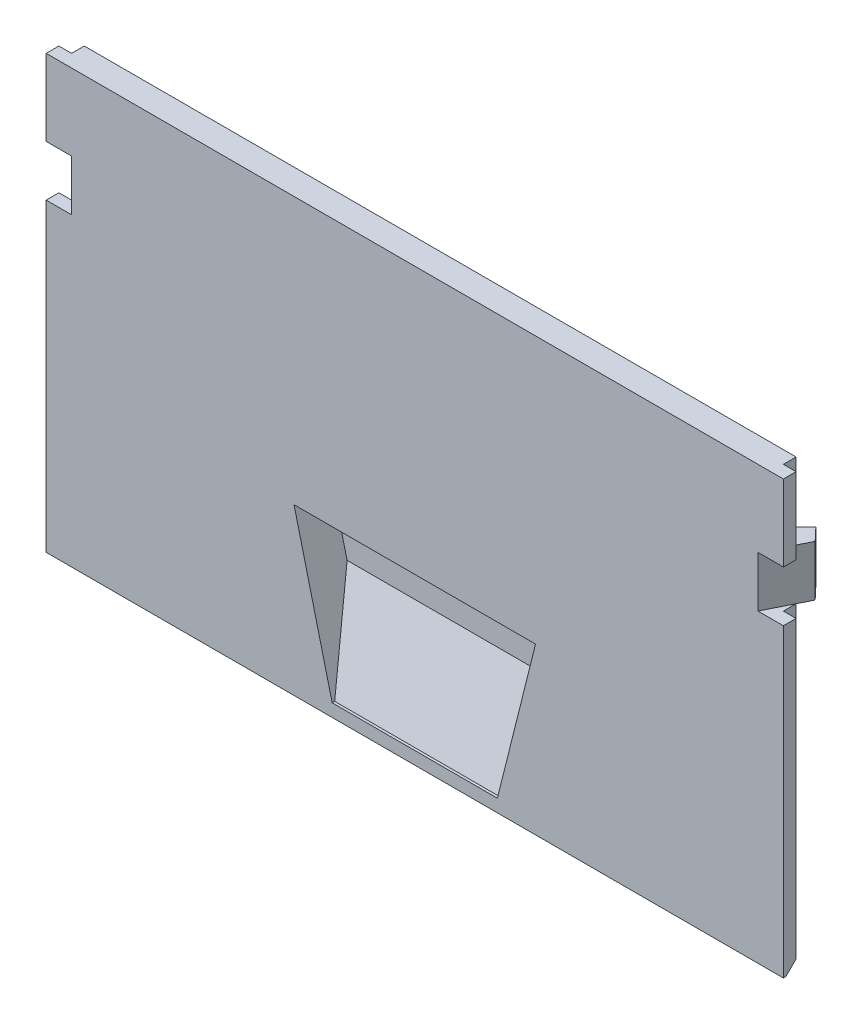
ISO-10303-21;
HEADER;
FILE_DESCRIPTION(('STEP AP214'),'2;1');
FILE_NAME('part.step','',(''),(''),'','','');
FILE_SCHEMA(('AUTOMOTIVE_DESIGN { 1 0 10303 214 1 1 1 1 }'));
ENDSEC;
DATA;
#1=APPLICATION_CONTEXT('core data for automotive mechanical design processes');
#2=APPLICATION_PROTOCOL_DEFINITION('international standard','automotive_design',2000,#1);
#3=PRODUCT_CONTEXT('',#1,'mechanical');
#4=PRODUCT('Part','Part','',(#3));
#5=PRODUCT_RELATED_PRODUCT_CATEGORY('part','',(#4));
#6=PRODUCT_DEFINITION_FORMATION('','',#4);
#7=PRODUCT_DEFINITION_CONTEXT('part definition',#1,'design');
#8=PRODUCT_DEFINITION('design','',#6,#7);
#9=PRODUCT_DEFINITION_SHAPE('','',#8);
#10=(LENGTH_UNIT() NAMED_UNIT(*) SI_UNIT(.MILLI.,.METRE.));
#11=(NAMED_UNIT(*) PLANE_ANGLE_UNIT() SI_UNIT($,.RADIAN.));
#12=(NAMED_UNIT(*) SI_UNIT($,.STERADIAN.) SOLID_ANGLE_UNIT());
#13=UNCERTAINTY_MEASURE_WITH_UNIT(LENGTH_MEASURE(1.E-05),#10,'distance_accuracy_value','');
#14=(GEOMETRIC_REPRESENTATION_CONTEXT(3) GLOBAL_UNCERTAINTY_ASSIGNED_CONTEXT((#13)) GLOBAL_UNIT_ASSIGNED_CONTEXT((#10,
#11,#12)) REPRESENTATION_CONTEXT('',''));
#15=CARTESIAN_POINT('',(0.,0.,0.));
#16=DIRECTION('',(0.,0.,1.));
#17=DIRECTION('',(1.,0.,0.));
#18=AXIS2_PLACEMENT_3D('',#15,#16,#17);
#19=CARTESIAN_POINT('',(-14.5,17.,-1.));
#20=DIRECTION('',(0.,0.,-1.));
#21=DIRECTION('',(-1.,0.,0.));
#22=AXIS2_PLACEMENT_3D('',#19,#20,#21);
#23=PLANE('',#22);
#24=DIRECTION('',(0.,-1.,0.));
#25=VECTOR('',#24,1.);
#26=CARTESIAN_POINT('',(14.,17.,-0.999999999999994));
#27=LINE('',#26,#25);
#28=CARTESIAN_POINT('',(14.,12.,-0.999999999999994));
#29=VERTEX_POINT('',#28);
#30=CARTESIAN_POINT('',(14.,0.900000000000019,-0.999999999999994));
#31=VERTEX_POINT('',#30);
#32=EDGE_CURVE('E514',#29,#31,#27,.T.);
#33=ORIENTED_EDGE('',*,*,#32,.T.);
#34=DIRECTION('',(-1.,0.,0.));
#35=VECTOR('',#34,1.);
#36=CARTESIAN_POINT('',(-14.5,0.900000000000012,-1.));
#37=LINE('',#36,#35);
#38=CARTESIAN_POINT('',(4.38077640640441,0.900000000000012,-1.));
#39=VERTEX_POINT('',#38);
#40=EDGE_CURVE('E460',#31,#39,#37,.T.);
#41=ORIENTED_EDGE('',*,*,#40,.T.);
#42=DIRECTION('',(-0.242535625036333,-0.970142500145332,0.));
#43=VECTOR('',#42,1.);
#44=CARTESIAN_POINT('',(6.65577640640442,9.99999999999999,-1.));
#45=LINE('',#44,#43);
#46=CARTESIAN_POINT('',(6.65577640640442,9.99999999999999,-1.));
#47=VERTEX_POINT('',#46);
#48=EDGE_CURVE('E407',#47,#39,#45,.T.);
#49=ORIENTED_EDGE('',*,*,#48,.F.);
#50=DIRECTION('',(1.,0.,0.));
#51=VECTOR('',#50,1.);
#52=CARTESIAN_POINT('',(6.65577640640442,9.99999999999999,-1.));
#53=LINE('',#52,#51);
#54=CARTESIAN_POINT('',(-6.65577640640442,9.99999999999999,-1.));
#55=VERTEX_POINT('',#54);
#56=EDGE_CURVE('E404',#55,#47,#53,.T.);
#57=ORIENTED_EDGE('',*,*,#56,.F.);
#58=DIRECTION('',(-0.242535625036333,0.970142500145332,0.));
#59=VECTOR('',#58,1.);
#60=CARTESIAN_POINT('',(-4.15577640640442,0.,-1.));
#61=LINE('',#60,#59);
#62=CARTESIAN_POINT('',(-4.38077640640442,0.900000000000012,-1.));
#63=VERTEX_POINT('',#62);
#64=EDGE_CURVE('E416',#63,#55,#61,.T.);
#65=ORIENTED_EDGE('',*,*,#64,.F.);
#66=DIRECTION('',(-1.,0.,0.));
#67=VECTOR('',#66,1.);
#68=CARTESIAN_POINT('',(-14.5,0.900000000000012,-1.));
#69=LINE('',#68,#67);
#70=CARTESIAN_POINT('',(-14.,0.900000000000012,-1.));
#71=VERTEX_POINT('',#70);
#72=EDGE_CURVE('E457',#63,#71,#69,.T.);
#73=ORIENTED_EDGE('',*,*,#72,.T.);
#74=DIRECTION('',(0.,1.,0.));
#75=VECTOR('',#74,1.);
#76=CARTESIAN_POINT('',(-14.,17.,-1.));
#77=LINE('',#76,#75);
#78=CARTESIAN_POINT('',(-14.,12.,-1.));
#79=VERTEX_POINT('',#78);
#80=EDGE_CURVE('E544',#71,#79,#77,.T.);
#81=ORIENTED_EDGE('',*,*,#80,.T.);
#82=DIRECTION('',(-1.,0.,0.));
#83=VECTOR('',#82,1.);
#84=CARTESIAN_POINT('',(-14.5,12.,-1.));
#85=LINE('',#84,#83);
#86=CARTESIAN_POINT('',(-12.7204163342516,12.,-1.));
#87=VERTEX_POINT('',#86);
#88=EDGE_CURVE('E352',#87,#79,#85,.T.);
#89=ORIENTED_EDGE('',*,*,#88,.F.);
#90=DIRECTION('',(0.,-1.,0.));
#91=VECTOR('',#90,1.);
#92=CARTESIAN_POINT('',(-12.7204163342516,14.,-1.));
#93=LINE('',#92,#91);
#94=CARTESIAN_POINT('',(-12.7204163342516,14.,-1.));
#95=VERTEX_POINT('',#94);
#96=EDGE_CURVE('E633',#95,#87,#93,.T.);
#97=ORIENTED_EDGE('',*,*,#96,.F.);
#98=DIRECTION('',(1.,0.,0.));
#99=VECTOR('',#98,1.);
#100=CARTESIAN_POINT('',(-14.5,14.,-1.));
#101=LINE('',#100,#99);
#102=CARTESIAN_POINT('',(-14.,14.,-1.));
#103=VERTEX_POINT('',#102);
#104=EDGE_CURVE('E357',#103,#95,#101,.T.);
#105=ORIENTED_EDGE('',*,*,#104,.F.);
#106=CARTESIAN_POINT('',(-14.,17.,-1.));
#107=VERTEX_POINT('',#106);
#108=EDGE_CURVE('E543',#103,#107,#77,.T.);
#109=ORIENTED_EDGE('',*,*,#108,.T.);
#110=DIRECTION('',(-1.,0.,0.));
#111=VECTOR('',#110,1.);
#112=CARTESIAN_POINT('',(-14.5,17.,-1.));
#113=LINE('',#112,#111);
#114=CARTESIAN_POINT('',(14.,17.,-0.999999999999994));
#115=VERTEX_POINT('',#114);
#116=EDGE_CURVE('E490',#115,#107,#113,.T.);
#117=ORIENTED_EDGE('',*,*,#116,.F.);
#118=CARTESIAN_POINT('',(14.,14.,-0.999999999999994));
#119=VERTEX_POINT('',#118);
#120=EDGE_CURVE('E527',#115,#119,#27,.T.);
#121=ORIENTED_EDGE('',*,*,#120,.T.);
#122=DIRECTION('',(1.,0.,0.));
#123=VECTOR('',#122,1.);
#124=CARTESIAN_POINT('',(-14.5,14.,-1.));
#125=LINE('',#124,#123);
#126=CARTESIAN_POINT('',(12.7204163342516,14.,-0.999999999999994));
#127=VERTEX_POINT('',#126);
#128=EDGE_CURVE('E330',#127,#119,#125,.T.);
#129=ORIENTED_EDGE('',*,*,#128,.F.);
#130=DIRECTION('',(0.,-1.,0.));
#131=VECTOR('',#130,1.);
#132=CARTESIAN_POINT('',(12.7204163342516,14.,-0.999999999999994));
#133=LINE('',#132,#131);
#134=CARTESIAN_POINT('',(12.7204163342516,12.,-0.999999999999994));
#135=VERTEX_POINT('',#134);
#136=EDGE_CURVE('E659',#127,#135,#133,.T.);
#137=ORIENTED_EDGE('',*,*,#136,.T.);
#138=DIRECTION('',(-1.,0.,0.));
#139=VECTOR('',#138,1.);
#140=CARTESIAN_POINT('',(-14.5,12.,-1.));
#141=LINE('',#140,#139);
#142=EDGE_CURVE('E334',#29,#135,#141,.T.);
#143=ORIENTED_EDGE('',*,*,#142,.F.);
#144=EDGE_LOOP('',(#33,#41,#49,#57,#65,#73,#81,#89,#97,#105,#109,#117,#121,#129,#137,#143));
#145=FACE_BOUND('',#144,.T.);
#146=ADVANCED_FACE('F28',(#145),#23,.T.);
#147=CARTESIAN_POINT('',(-14.5,14.,-2.));
#148=DIRECTION('',(0.,1.,0.));
#149=DIRECTION('',(0.,0.,1.));
#150=AXIS2_PLACEMENT_3D('',#147,#148,#149);
#151=PLANE('',#150);
#152=DIRECTION('',(0.447213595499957,0.,0.894427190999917));
#153=VECTOR('',#152,1.);
#154=CARTESIAN_POINT('',(-13.5,14.,0.));
#155=LINE('',#154,#153);
#156=CARTESIAN_POINT('',(-13.5,14.,0.));
#157=VERTEX_POINT('',#156);
#158=EDGE_CURVE('E611',#103,#157,#155,.T.);
#159=ORIENTED_EDGE('',*,*,#158,.T.);
#160=DIRECTION('',(-1.,0.,0.));
#161=VECTOR('',#160,1.);
#162=CARTESIAN_POINT('',(-14.5,14.,0.));
#163=LINE('',#162,#161);
#164=CARTESIAN_POINT('',(-14.5,14.,0.));
#165=VERTEX_POINT('',#164);
#166=EDGE_CURVE('E342',#157,#165,#163,.T.);
#167=ORIENTED_EDGE('',*,*,#166,.T.);
#168=DIRECTION('',(0.,0.,1.));
#169=VECTOR('',#168,1.);
#170=CARTESIAN_POINT('',(-14.5,14.,-2.));
#171=LINE('',#170,#169);
#172=CARTESIAN_POINT('',(-14.5,14.,-0.5));
#173=VERTEX_POINT('',#172);
#174=EDGE_CURVE('E345',#173,#165,#171,.T.);
#175=ORIENTED_EDGE('',*,*,#174,.F.);
#176=DIRECTION('',(-1.,0.,0.));
#177=VECTOR('',#176,1.);
#178=CARTESIAN_POINT('',(-14.5,14.,-0.5));
#179=LINE('',#178,#177);
#180=CARTESIAN_POINT('',(-14.,14.,-0.5));
#181=VERTEX_POINT('',#180);
#182=EDGE_CURVE('E434',#181,#173,#179,.T.);
#183=ORIENTED_EDGE('',*,*,#182,.F.);
#184=DIRECTION('',(0.,0.,-1.));
#185=VECTOR('',#184,1.);
#186=CARTESIAN_POINT('',(-14.,14.,-0.5));
#187=LINE('',#186,#185);
#188=EDGE_CURVE('E355',#181,#103,#187,.T.);
#189=ORIENTED_EDGE('',*,*,#188,.T.);
#190=EDGE_LOOP('',(#159,#167,#175,#183,#189));
#191=FACE_BOUND('',#190,.T.);
#192=ADVANCED_FACE('F610',(#191),#151,.F.);
#193=CARTESIAN_POINT('',(-14.5,12.,-2.));
#194=DIRECTION('',(0.,-1.,0.));
#195=DIRECTION('',(0.,0.,-1.));
#196=AXIS2_PLACEMENT_3D('',#193,#194,#195);
#197=PLANE('',#196);
#198=DIRECTION('',(0.447213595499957,0.,0.894427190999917));
#199=VECTOR('',#198,1.);
#200=CARTESIAN_POINT('',(-14.5,12.,-2.));
#201=LINE('',#200,#199);
#202=CARTESIAN_POINT('',(-13.5,12.,0.));
#203=VERTEX_POINT('',#202);
#204=EDGE_CURVE('E441',#79,#203,#201,.T.);
#205=ORIENTED_EDGE('',*,*,#204,.F.);
#206=DIRECTION('',(0.,0.,1.));
#207=VECTOR('',#206,1.);
#208=CARTESIAN_POINT('',(-14.,12.,-0.5));
#209=LINE('',#208,#207);
#210=CARTESIAN_POINT('',(-14.,12.,-0.5));
#211=VERTEX_POINT('',#210);
#212=EDGE_CURVE('E348',#79,#211,#209,.T.);
#213=ORIENTED_EDGE('',*,*,#212,.T.);
#214=DIRECTION('',(1.,0.,0.));
#215=VECTOR('',#214,1.);
#216=CARTESIAN_POINT('',(-14.5,12.,-0.5));
#217=LINE('',#216,#215);
#218=CARTESIAN_POINT('',(-14.5,12.,-0.5));
#219=VERTEX_POINT('',#218);
#220=EDGE_CURVE('E431',#219,#211,#217,.T.);
#221=ORIENTED_EDGE('',*,*,#220,.F.);
#222=DIRECTION('',(0.,0.,1.));
#223=VECTOR('',#222,1.);
#224=CARTESIAN_POINT('',(-14.5,12.,-2.));
#225=LINE('',#224,#223);
#226=CARTESIAN_POINT('',(-14.5,12.,0.));
#227=VERTEX_POINT('',#226);
#228=EDGE_CURVE('E344',#219,#227,#225,.T.);
#229=ORIENTED_EDGE('',*,*,#228,.T.);
#230=DIRECTION('',(1.,0.,0.));
#231=VECTOR('',#230,1.);
#232=CARTESIAN_POINT('',(-14.5,12.,0.));
#233=LINE('',#232,#231);
#234=EDGE_CURVE('E336',#227,#203,#233,.T.);
#235=ORIENTED_EDGE('',*,*,#234,.T.);
#236=EDGE_LOOP('',(#205,#213,#221,#229,#235));
#237=FACE_BOUND('',#236,.T.);
#238=ADVANCED_FACE('F624',(#237),#197,.F.);
#239=CARTESIAN_POINT('',(14.5,0.,-0.999999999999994));
#240=DIRECTION('',(1.,0.,0.));
#241=DIRECTION('',(0.,0.,-1.));
#242=AXIS2_PLACEMENT_3D('',#239,#240,#241);
#243=PLANE('',#242);
#244=DIRECTION('',(0.,0.,1.));
#245=VECTOR('',#244,1.);
#246=CARTESIAN_POINT('',(14.5,0.,-0.999999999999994));
#247=LINE('',#246,#245);
#248=CARTESIAN_POINT('',(14.5,0.,-0.099999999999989));
#249=VERTEX_POINT('',#248);
#250=CARTESIAN_POINT('',(14.5,0.,0.));
#251=VERTEX_POINT('',#250);
#252=EDGE_CURVE('E480',#249,#251,#247,.T.);
#253=ORIENTED_EDGE('',*,*,#252,.F.);
#254=DIRECTION('',(0.,-0.70710678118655,0.707106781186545));
#255=VECTOR('',#254,1.);
#256=CARTESIAN_POINT('',(14.5,0.450000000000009,-0.549999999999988));
#257=LINE('',#256,#255);
#258=CARTESIAN_POINT('',(14.5,0.400000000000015,-0.499999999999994));
#259=VERTEX_POINT('',#258);
#260=EDGE_CURVE('E451',#249,#259,#257,.F.);
#261=ORIENTED_EDGE('',*,*,#260,.T.);
#262=DIRECTION('',(0.,1.,0.));
#263=VECTOR('',#262,1.);
#264=CARTESIAN_POINT('',(14.5,17.,-0.499999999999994));
#265=LINE('',#264,#263);
#266=CARTESIAN_POINT('',(14.5,12.,-0.499999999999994));
#267=VERTEX_POINT('',#266);
#268=EDGE_CURVE('E531',#259,#267,#265,.T.);
#269=ORIENTED_EDGE('',*,*,#268,.T.);
#270=DIRECTION('',(0.,0.,1.));
#271=VECTOR('',#270,1.);
#272=CARTESIAN_POINT('',(14.5,12.,-1.99999999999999));
#273=LINE('',#272,#271);
#274=CARTESIAN_POINT('',(14.5,12.,0.));
#275=VERTEX_POINT('',#274);
#276=EDGE_CURVE('E323',#267,#275,#273,.T.);
#277=ORIENTED_EDGE('',*,*,#276,.T.);
#278=DIRECTION('',(0.,1.,0.));
#279=VECTOR('',#278,1.);
#280=CARTESIAN_POINT('',(14.5,0.,0.));
#281=LINE('',#280,#279);
#282=EDGE_CURVE('E320',#251,#275,#281,.T.);
#283=ORIENTED_EDGE('',*,*,#282,.F.);
#284=EDGE_LOOP('',(#253,#261,#269,#277,#283));
#285=FACE_BOUND('',#284,.T.);
#286=ADVANCED_FACE('F482',(#285),#243,.T.);
#287=CARTESIAN_POINT('',(14.,17.,-0.499999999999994));
#288=DIRECTION('',(1.,0.,0.));
#289=DIRECTION('',(0.,1.,0.));
#290=AXIS2_PLACEMENT_3D('',#287,#288,#289);
#291=PLANE('',#290);
#292=DIRECTION('',(0.,-1.,0.));
#293=VECTOR('',#292,1.);
#294=CARTESIAN_POINT('',(14.,17.,-0.499999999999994));
#295=LINE('',#294,#293);
#296=CARTESIAN_POINT('',(14.,12.,-0.499999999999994));
#297=VERTEX_POINT('',#296);
#298=CARTESIAN_POINT('',(14.,0.400000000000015,-0.499999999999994));
#299=VERTEX_POINT('',#298);
#300=EDGE_CURVE('E536',#297,#299,#295,.T.);
#301=ORIENTED_EDGE('',*,*,#300,.T.);
#302=DIRECTION('',(0.,-0.70710678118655,0.707106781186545));
#303=VECTOR('',#302,1.);
#304=CARTESIAN_POINT('',(14.,8.70000000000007,-8.8));
#305=LINE('',#304,#303);
#306=EDGE_CURVE('E455',#299,#31,#305,.F.);
#307=ORIENTED_EDGE('',*,*,#306,.T.);
#308=ORIENTED_EDGE('',*,*,#32,.F.);
#309=DIRECTION('',(0.,0.,-1.));
#310=VECTOR('',#309,1.);
#311=CARTESIAN_POINT('',(14.,12.,-0.499999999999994));
#312=LINE('',#311,#310);
#313=EDGE_CURVE('E312',#297,#29,#312,.T.);
#314=ORIENTED_EDGE('',*,*,#313,.F.);
#315=EDGE_LOOP('',(#301,#307,#308,#314));
#316=FACE_BOUND('',#315,.T.);
#317=ADVANCED_FACE('F690',(#316),#291,.T.);
#318=CARTESIAN_POINT('',(14.5,0.,-0.499999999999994));
#319=DIRECTION('',(0.,0.,-1.));
#320=DIRECTION('',(-1.,0.,0.));
#321=AXIS2_PLACEMENT_3D('',#318,#319,#320);
#322=PLANE('',#321);
#323=ORIENTED_EDGE('',*,*,#268,.F.);
#324=DIRECTION('',(1.,0.,0.));
#325=VECTOR('',#324,1.);
#326=CARTESIAN_POINT('',(14.5,0.400000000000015,-0.499999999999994));
#327=LINE('',#326,#325);
#328=EDGE_CURVE('E453',#259,#299,#327,.F.);
#329=ORIENTED_EDGE('',*,*,#328,.T.);
#330=ORIENTED_EDGE('',*,*,#300,.F.);
#331=DIRECTION('',(-1.,0.,0.));
#332=VECTOR('',#331,1.);
#333=CARTESIAN_POINT('',(14.5,12.,-0.499999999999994));
#334=LINE('',#333,#332);
#335=EDGE_CURVE('E439',#267,#297,#334,.T.);
#336=ORIENTED_EDGE('',*,*,#335,.F.);
#337=EDGE_LOOP('',(#323,#329,#330,#336));
#338=FACE_BOUND('',#337,.T.);
#339=ADVANCED_FACE('F830',(#338),#322,.T.);
#340=CARTESIAN_POINT('',(-14.5,0.,-1.));
#341=DIRECTION('',(-1.,0.,0.));
#342=DIRECTION('',(0.,0.,1.));
#343=AXIS2_PLACEMENT_3D('',#340,#341,#342);
#344=PLANE('',#343);
#345=ORIENTED_EDGE('',*,*,#174,.T.);
#346=DIRECTION('',(0.,-1.,0.));
#347=VECTOR('',#346,1.);
#348=CARTESIAN_POINT('',(-14.5,0.,0.));
#349=LINE('',#348,#347);
#350=CARTESIAN_POINT('',(-14.5,17.,0.));
#351=VERTEX_POINT('',#350);
#352=EDGE_CURVE('E560',#351,#165,#349,.T.);
#353=ORIENTED_EDGE('',*,*,#352,.F.);
#354=DIRECTION('',(0.,0.,1.));
#355=VECTOR('',#354,1.);
#356=CARTESIAN_POINT('',(-14.5,17.,-1.));
#357=LINE('',#356,#355);
#358=CARTESIAN_POINT('',(-14.5,17.,-0.5));
#359=VERTEX_POINT('',#358);
#360=EDGE_CURVE('E488',#359,#351,#357,.T.);
#361=ORIENTED_EDGE('',*,*,#360,.F.);
#362=DIRECTION('',(0.,-1.,0.));
#363=VECTOR('',#362,1.);
#364=CARTESIAN_POINT('',(-14.5,17.,-0.5));
#365=LINE('',#364,#363);
#366=EDGE_CURVE('E547',#359,#173,#365,.T.);
#367=ORIENTED_EDGE('',*,*,#366,.T.);
#368=EDGE_LOOP('',(#345,#353,#361,#367));
#369=FACE_BOUND('',#368,.T.);
#370=ADVANCED_FACE('F580',(#369),#344,.T.);
#371=CARTESIAN_POINT('',(-14.,17.,-0.5));
#372=DIRECTION('',(-1.,0.,0.));
#373=DIRECTION('',(0.,-1.,0.));
#374=AXIS2_PLACEMENT_3D('',#371,#372,#373);
#375=PLANE('',#374);
#376=ORIENTED_EDGE('',*,*,#188,.F.);
#377=DIRECTION('',(0.,1.,0.));
#378=VECTOR('',#377,1.);
#379=CARTESIAN_POINT('',(-14.,17.,-0.5));
#380=LINE('',#379,#378);
#381=CARTESIAN_POINT('',(-14.,17.,-0.5));
#382=VERTEX_POINT('',#381);
#383=EDGE_CURVE('E550',#181,#382,#380,.T.);
#384=ORIENTED_EDGE('',*,*,#383,.T.);
#385=DIRECTION('',(0.,0.,-1.));
#386=VECTOR('',#385,1.);
#387=CARTESIAN_POINT('',(-14.,17.,-0.5));
#388=LINE('',#387,#386);
#389=EDGE_CURVE('E556',#382,#107,#388,.T.);
#390=ORIENTED_EDGE('',*,*,#389,.T.);
#391=ORIENTED_EDGE('',*,*,#108,.F.);
#392=EDGE_LOOP('',(#376,#384,#390,#391));
#393=FACE_BOUND('',#392,.T.);
#394=ADVANCED_FACE('F604',(#393),#375,.T.);
#395=CARTESIAN_POINT('',(-14.5,0.,-0.5));
#396=DIRECTION('',(0.,0.,1.));
#397=DIRECTION('',(1.,0.,0.));
#398=AXIS2_PLACEMENT_3D('',#395,#396,#397);
#399=PLANE('',#398);
#400=ORIENTED_EDGE('',*,*,#383,.F.);
#401=ORIENTED_EDGE('',*,*,#182,.T.);
#402=ORIENTED_EDGE('',*,*,#366,.F.);
#403=DIRECTION('',(-1.,0.,0.));
#404=VECTOR('',#403,1.);
#405=CARTESIAN_POINT('',(-14.5,17.,-0.5));
#406=LINE('',#405,#404);
#407=EDGE_CURVE('E553',#382,#359,#406,.T.);
#408=ORIENTED_EDGE('',*,*,#407,.F.);
#409=EDGE_LOOP('',(#400,#401,#402,#408));
#410=FACE_BOUND('',#409,.T.);
#411=ADVANCED_FACE('F608',(#410),#399,.F.);
#412=CARTESIAN_POINT('',(3.25,0.5,0.));
#413=DIRECTION('',(0.,-1.,0.));
#414=DIRECTION('',(0.,0.,-1.));
#415=AXIS2_PLACEMENT_3D('',#412,#413,#414);
#416=PLANE('',#415);
#417=DIRECTION('',(0.,0.,-1.));
#418=VECTOR('',#417,1.);
#419=CARTESIAN_POINT('',(3.25,0.5,0.));
#420=LINE('',#419,#418);
#421=CARTESIAN_POINT('',(3.25,0.5,0.));
#422=VERTEX_POINT('',#421);
#423=CARTESIAN_POINT('',(3.25,0.5,-0.100000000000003));
#424=VERTEX_POINT('',#423);
#425=EDGE_CURVE('E516',#422,#424,#420,.T.);
#426=ORIENTED_EDGE('',*,*,#425,.T.);
#427=DIRECTION('',(-1.,0.,0.));
#428=VECTOR('',#427,1.);
#429=CARTESIAN_POINT('',(-3.25,0.5,-0.100000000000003));
#430=LINE('',#429,#428);
#431=CARTESIAN_POINT('',(-3.25,0.5,-0.100000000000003));
#432=VERTEX_POINT('',#431);
#433=EDGE_CURVE('E735',#424,#432,#430,.T.);
#434=ORIENTED_EDGE('',*,*,#433,.T.);
#435=DIRECTION('',(0.,0.,-1.));
#436=VECTOR('',#435,1.);
#437=CARTESIAN_POINT('',(-3.25,0.5,0.));
#438=LINE('',#437,#436);
#439=CARTESIAN_POINT('',(-3.25,0.5,0.));
#440=VERTEX_POINT('',#439);
#441=EDGE_CURVE('E508',#440,#432,#438,.T.);
#442=ORIENTED_EDGE('',*,*,#441,.F.);
#443=DIRECTION('',(-1.,0.,0.));
#444=VECTOR('',#443,1.);
#445=CARTESIAN_POINT('',(3.25,0.5,0.));
#446=LINE('',#445,#444);
#447=EDGE_CURVE('E718',#422,#440,#446,.T.);
#448=ORIENTED_EDGE('',*,*,#447,.F.);
#449=EDGE_LOOP('',(#426,#434,#442,#448));
#450=FACE_BOUND('',#449,.T.);
#451=ADVANCED_FACE('F734',(#450),#416,.F.);
#452=DIRECTION('',(1.,0.,0.));
#453=VECTOR('',#452,1.);
#454=CARTESIAN_POINT('',(-4.75,6.5,-1.));
#455=LINE('',#454,#453);
#456=CARTESIAN_POINT('',(-4.75,6.5,-1.));
#457=VERTEX_POINT('',#456);
#458=CARTESIAN_POINT('',(4.75,6.5,-1.));
#459=VERTEX_POINT('',#458);
#460=EDGE_CURVE('E702',#457,#459,#455,.T.);
#461=ORIENTED_EDGE('',*,*,#460,.F.);
#462=DIRECTION('',(-0.242535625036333,0.970142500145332,0.));
#463=VECTOR('',#462,1.);
#464=CARTESIAN_POINT('',(-3.25,0.5,-1.));
#465=LINE('',#464,#463);
#466=CARTESIAN_POINT('',(-5.375,8.99999999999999,-1.));
#467=VERTEX_POINT('',#466);
#468=EDGE_CURVE('E499',#457,#467,#465,.T.);
#469=ORIENTED_EDGE('',*,*,#468,.T.);
#470=DIRECTION('',(1.,0.,0.));
#471=VECTOR('',#470,1.);
#472=CARTESIAN_POINT('',(5.375,8.99999999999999,-1.));
#473=LINE('',#472,#471);
#474=CARTESIAN_POINT('',(5.375,8.99999999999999,-1.));
#475=VERTEX_POINT('',#474);
#476=EDGE_CURVE('E389',#467,#475,#473,.T.);
#477=ORIENTED_EDGE('',*,*,#476,.T.);
#478=DIRECTION('',(-0.242535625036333,-0.970142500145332,0.));
#479=VECTOR('',#478,1.);
#480=CARTESIAN_POINT('',(5.375,8.99999999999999,-1.));
#481=LINE('',#480,#479);
#482=EDGE_CURVE('E392',#475,#459,#481,.T.);
#483=ORIENTED_EDGE('',*,*,#482,.T.);
#484=EDGE_LOOP('',(#461,#469,#477,#483));
#485=FACE_BOUND('',#484,.T.);
#486=ADVANCED_FACE('F765',(#485),#23,.T.);
#487=CARTESIAN_POINT('',(-14.5,17.,-1.));
#488=DIRECTION('',(0.,1.,0.));
#489=DIRECTION('',(0.,0.,1.));
#490=AXIS2_PLACEMENT_3D('',#487,#488,#489);
#491=PLANE('',#490);
#492=DIRECTION('',(-1.,0.,0.));
#493=VECTOR('',#492,1.);
#494=CARTESIAN_POINT('',(14.5,17.,-0.499999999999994));
#495=LINE('',#494,#493);
#496=CARTESIAN_POINT('',(14.5,17.,-0.499999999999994));
#497=VERTEX_POINT('',#496);
#498=CARTESIAN_POINT('',(14.,17.,-0.499999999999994));
#499=VERTEX_POINT('',#498);
#500=EDGE_CURVE('E533',#497,#499,#495,.T.);
#501=ORIENTED_EDGE('',*,*,#500,.T.);
#502=DIRECTION('',(0.,0.,-1.));
#503=VECTOR('',#502,1.);
#504=CARTESIAN_POINT('',(14.,17.,-0.499999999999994));
#505=LINE('',#504,#503);
#506=EDGE_CURVE('E540',#499,#115,#505,.T.);
#507=ORIENTED_EDGE('',*,*,#506,.T.);
#508=ORIENTED_EDGE('',*,*,#116,.T.);
#509=ORIENTED_EDGE('',*,*,#389,.F.);
#510=ORIENTED_EDGE('',*,*,#407,.T.);
#511=ORIENTED_EDGE('',*,*,#360,.T.);
#512=DIRECTION('',(-1.,0.,0.));
#513=VECTOR('',#512,1.);
#514=CARTESIAN_POINT('',(-14.5,17.,0.));
#515=LINE('',#514,#513);
#516=CARTESIAN_POINT('',(14.5,17.,0.));
#517=VERTEX_POINT('',#516);
#518=EDGE_CURVE('E567',#517,#351,#515,.T.);
#519=ORIENTED_EDGE('',*,*,#518,.F.);
#520=DIRECTION('',(0.,0.,1.));
#521=VECTOR('',#520,1.);
#522=CARTESIAN_POINT('',(14.5,17.,-0.999999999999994));
#523=LINE('',#522,#521);
#524=EDGE_CURVE('E484',#497,#517,#523,.T.);
#525=ORIENTED_EDGE('',*,*,#524,.F.);
#526=EDGE_LOOP('',(#501,#507,#508,#509,#510,#511,#519,#525));
#527=FACE_BOUND('',#526,.T.);
#528=ADVANCED_FACE('F575',(#527),#491,.T.);
#529=CARTESIAN_POINT('',(-14.5,0.,-1.));
#530=DIRECTION('',(0.,-1.,0.));
#531=DIRECTION('',(0.,0.,-1.));
#532=AXIS2_PLACEMENT_3D('',#529,#530,#531);
#533=PLANE('',#532);
#534=DIRECTION('',(0.,0.,1.));
#535=VECTOR('',#534,1.);
#536=CARTESIAN_POINT('',(4.15577640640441,0.,-2.));
#537=LINE('',#536,#535);
#538=CARTESIAN_POINT('',(4.15577640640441,0.,-1.5));
#539=VERTEX_POINT('',#538);
#540=CARTESIAN_POINT('',(4.15577640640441,0.,-0.0999999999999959));
#541=VERTEX_POINT('',#540);
#542=EDGE_CURVE('E424',#539,#541,#537,.T.);
#543=ORIENTED_EDGE('',*,*,#542,.T.);
#544=DIRECTION('',(1.,0.,0.));
#545=VECTOR('',#544,1.);
#546=CARTESIAN_POINT('',(-14.5,0.,-0.0999999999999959));
#547=LINE('',#546,#545);
#548=EDGE_CURVE('E448',#541,#249,#547,.T.);
#549=ORIENTED_EDGE('',*,*,#548,.T.);
#550=ORIENTED_EDGE('',*,*,#252,.T.);
#551=DIRECTION('',(1.,0.,0.));
#552=VECTOR('',#551,1.);
#553=CARTESIAN_POINT('',(-14.5,0.,0.));
#554=LINE('',#553,#552);
#555=CARTESIAN_POINT('',(-14.5,0.,0.));
#556=VERTEX_POINT('',#555);
#557=EDGE_CURVE('E563',#556,#251,#554,.T.);
#558=ORIENTED_EDGE('',*,*,#557,.F.);
#559=DIRECTION('',(0.,0.,1.));
#560=VECTOR('',#559,1.);
#561=CARTESIAN_POINT('',(-14.5,0.,-1.));
#562=LINE('',#561,#560);
#563=CARTESIAN_POINT('',(-14.5,0.,-0.0999999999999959));
#564=VERTEX_POINT('',#563);
#565=EDGE_CURVE('E485',#564,#556,#562,.T.);
#566=ORIENTED_EDGE('',*,*,#565,.F.);
#567=DIRECTION('',(1.,0.,0.));
#568=VECTOR('',#567,1.);
#569=CARTESIAN_POINT('',(-14.5,0.,-0.0999999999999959));
#570=LINE('',#569,#568);
#571=CARTESIAN_POINT('',(-4.15577640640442,0.,-0.0999999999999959));
#572=VERTEX_POINT('',#571);
#573=EDGE_CURVE('E445',#564,#572,#570,.T.);
#574=ORIENTED_EDGE('',*,*,#573,.T.);
#575=DIRECTION('',(0.,0.,1.));
#576=VECTOR('',#575,1.);
#577=CARTESIAN_POINT('',(-4.15577640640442,0.,-2.));
#578=LINE('',#577,#576);
#579=CARTESIAN_POINT('',(-4.15577640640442,0.,-1.5));
#580=VERTEX_POINT('',#579);
#581=EDGE_CURVE('E428',#580,#572,#578,.T.);
#582=ORIENTED_EDGE('',*,*,#581,.F.);
#583=DIRECTION('',(1.,0.,0.));
#584=VECTOR('',#583,1.);
#585=CARTESIAN_POINT('',(-5.25,0.,-1.5));
#586=LINE('',#585,#584);
#587=EDGE_CURVE('E360',#580,#539,#586,.T.);
#588=ORIENTED_EDGE('',*,*,#587,.T.);
#589=EDGE_LOOP('',(#543,#549,#550,#558,#566,#574,#582,#588));
#590=FACE_BOUND('',#589,.T.);
#591=ADVANCED_FACE('F478',(#590),#533,.T.);
#592=DIRECTION('',(0.,0.,1.));
#593=VECTOR('',#592,1.);
#594=CARTESIAN_POINT('',(14.5,14.,-1.99999999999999));
#595=LINE('',#594,#593);
#596=CARTESIAN_POINT('',(14.5,14.,-0.499999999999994));
#597=VERTEX_POINT('',#596);
#598=CARTESIAN_POINT('',(14.5,14.,0.));
#599=VERTEX_POINT('',#598);
#600=EDGE_CURVE('E321',#597,#599,#595,.T.);
#601=ORIENTED_EDGE('',*,*,#600,.F.);
#602=EDGE_CURVE('E530',#597,#497,#265,.T.);
#603=ORIENTED_EDGE('',*,*,#602,.T.);
#604=ORIENTED_EDGE('',*,*,#524,.T.);
#605=EDGE_CURVE('E565',#599,#517,#281,.T.);
#606=ORIENTED_EDGE('',*,*,#605,.F.);
#607=EDGE_LOOP('',(#601,#603,#604,#606));
#608=FACE_BOUND('',#607,.T.);
#609=ADVANCED_FACE('F585',(#608),#243,.T.);
#610=CARTESIAN_POINT('',(-14.5,0.400000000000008,-0.5));
#611=VERTEX_POINT('',#610);
#612=EDGE_CURVE('E546',#219,#611,#365,.T.);
#613=ORIENTED_EDGE('',*,*,#612,.T.);
#614=DIRECTION('',(0.,0.70710678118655,-0.707106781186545));
#615=VECTOR('',#614,1.);
#616=CARTESIAN_POINT('',(-14.5,0.450000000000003,-0.549999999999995));
#617=LINE('',#616,#615);
#618=EDGE_CURVE('E464',#611,#564,#617,.F.);
#619=ORIENTED_EDGE('',*,*,#618,.T.);
#620=ORIENTED_EDGE('',*,*,#565,.T.);
#621=EDGE_CURVE('E559',#227,#556,#349,.T.);
#622=ORIENTED_EDGE('',*,*,#621,.F.);
#623=ORIENTED_EDGE('',*,*,#228,.F.);
#624=EDGE_LOOP('',(#613,#619,#620,#622,#623));
#625=FACE_BOUND('',#624,.T.);
#626=ADVANCED_FACE('F30',(#625),#344,.T.);
#627=CARTESIAN_POINT('',(-14.5,17.,0.));
#628=DIRECTION('',(0.,0.,-1.));
#629=DIRECTION('',(-1.,0.,0.));
#630=AXIS2_PLACEMENT_3D('',#627,#628,#629);
#631=PLANE('',#630);
#632=DIRECTION('',(1.,0.,0.));
#633=VECTOR('',#632,1.);
#634=CARTESIAN_POINT('',(-4.75,6.5,0.));
#635=LINE('',#634,#633);
#636=CARTESIAN_POINT('',(-4.75,6.5,0.));
#637=VERTEX_POINT('',#636);
#638=CARTESIAN_POINT('',(4.75,6.5,0.));
#639=VERTEX_POINT('',#638);
#640=EDGE_CURVE('E522',#637,#639,#635,.T.);
#641=ORIENTED_EDGE('',*,*,#640,.T.);
#642=DIRECTION('',(-0.242535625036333,-0.970142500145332,0.));
#643=VECTOR('',#642,1.);
#644=CARTESIAN_POINT('',(4.75,6.5,0.));
#645=LINE('',#644,#643);
#646=EDGE_CURVE('E715',#639,#422,#645,.T.);
#647=ORIENTED_EDGE('',*,*,#646,.T.);
#648=ORIENTED_EDGE('',*,*,#447,.T.);
#649=DIRECTION('',(-0.242535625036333,0.970142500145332,0.));
#650=VECTOR('',#649,1.);
#651=CARTESIAN_POINT('',(-3.25,0.5,0.));
#652=LINE('',#651,#650);
#653=EDGE_CURVE('E720',#440,#637,#652,.T.);
#654=ORIENTED_EDGE('',*,*,#653,.T.);
#655=EDGE_LOOP('',(#641,#647,#648,#654));
#656=FACE_BOUND('',#655,.T.);
#657=ORIENTED_EDGE('',*,*,#282,.T.);
#658=DIRECTION('',(1.,0.,0.));
#659=VECTOR('',#658,1.);
#660=CARTESIAN_POINT('',(14.5,12.,0.));
#661=LINE('',#660,#659);
#662=CARTESIAN_POINT('',(13.5,12.,0.));
#663=VERTEX_POINT('',#662);
#664=EDGE_CURVE('E303',#663,#275,#661,.T.);
#665=ORIENTED_EDGE('',*,*,#664,.F.);
#666=DIRECTION('',(0.,-1.,0.));
#667=VECTOR('',#666,1.);
#668=CARTESIAN_POINT('',(13.5,14.,0.));
#669=LINE('',#668,#667);
#670=CARTESIAN_POINT('',(13.5,14.,0.));
#671=VERTEX_POINT('',#670);
#672=EDGE_CURVE('E291',#671,#663,#669,.T.);
#673=ORIENTED_EDGE('',*,*,#672,.F.);
#674=DIRECTION('',(-1.,0.,0.));
#675=VECTOR('',#674,1.);
#676=CARTESIAN_POINT('',(14.5,14.,0.));
#677=LINE('',#676,#675);
#678=EDGE_CURVE('E304',#599,#671,#677,.T.);
#679=ORIENTED_EDGE('',*,*,#678,.F.);
#680=ORIENTED_EDGE('',*,*,#605,.T.);
#681=ORIENTED_EDGE('',*,*,#518,.T.);
#682=ORIENTED_EDGE('',*,*,#352,.T.);
#683=ORIENTED_EDGE('',*,*,#166,.F.);
#684=DIRECTION('',(0.,1.,0.));
#685=VECTOR('',#684,1.);
#686=CARTESIAN_POINT('',(-13.5,14.,0.));
#687=LINE('',#686,#685);
#688=EDGE_CURVE('E339',#203,#157,#687,.T.);
#689=ORIENTED_EDGE('',*,*,#688,.F.);
#690=ORIENTED_EDGE('',*,*,#234,.F.);
#691=ORIENTED_EDGE('',*,*,#621,.T.);
#692=ORIENTED_EDGE('',*,*,#557,.T.);
#693=EDGE_LOOP('',(#657,#665,#673,#679,#680,#681,#682,#683,#689,#690,#691,#692));
#694=FACE_BOUND('',#693,.T.);
#695=ADVANCED_FACE('F317',(#656,#694),#631,.F.);
#696=ORIENTED_EDGE('',*,*,#80,.F.);
#697=DIRECTION('',(0.,0.70710678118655,-0.707106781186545));
#698=VECTOR('',#697,1.);
#699=CARTESIAN_POINT('',(-14.,8.70000000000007,-8.8));
#700=LINE('',#699,#698);
#701=CARTESIAN_POINT('',(-14.,0.400000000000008,-0.5));
#702=VERTEX_POINT('',#701);
#703=EDGE_CURVE('E51',#71,#702,#700,.F.);
#704=ORIENTED_EDGE('',*,*,#703,.T.);
#705=EDGE_CURVE('E551',#702,#211,#380,.T.);
#706=ORIENTED_EDGE('',*,*,#705,.T.);
#707=ORIENTED_EDGE('',*,*,#212,.F.);
#708=EDGE_LOOP('',(#696,#704,#706,#707));
#709=FACE_BOUND('',#708,.T.);
#710=ADVANCED_FACE('F625',(#709),#375,.T.);
#711=ORIENTED_EDGE('',*,*,#705,.F.);
#712=DIRECTION('',(1.,0.,0.));
#713=VECTOR('',#712,1.);
#714=CARTESIAN_POINT('',(-14.5,0.400000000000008,-0.5));
#715=LINE('',#714,#713);
#716=EDGE_CURVE('E43',#702,#611,#715,.F.);
#717=ORIENTED_EDGE('',*,*,#716,.T.);
#718=ORIENTED_EDGE('',*,*,#612,.F.);
#719=ORIENTED_EDGE('',*,*,#220,.T.);
#720=EDGE_LOOP('',(#711,#717,#718,#719));
#721=FACE_BOUND('',#720,.T.);
#722=ADVANCED_FACE('F833',(#721),#399,.F.);
#723=DIRECTION('',(0.,0.,1.));
#724=VECTOR('',#723,1.);
#725=CARTESIAN_POINT('',(14.,14.,-0.499999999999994));
#726=LINE('',#725,#724);
#727=CARTESIAN_POINT('',(14.,14.,-0.499999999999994));
#728=VERTEX_POINT('',#727);
#729=EDGE_CURVE('E327',#119,#728,#726,.T.);
#730=ORIENTED_EDGE('',*,*,#729,.F.);
#731=ORIENTED_EDGE('',*,*,#120,.F.);
#732=ORIENTED_EDGE('',*,*,#506,.F.);
#733=EDGE_CURVE('E537',#499,#728,#295,.T.);
#734=ORIENTED_EDGE('',*,*,#733,.T.);
#735=EDGE_LOOP('',(#730,#731,#732,#734));
#736=FACE_BOUND('',#735,.T.);
#737=ADVANCED_FACE('F595',(#736),#291,.T.);
#738=DIRECTION('',(1.,0.,0.));
#739=VECTOR('',#738,1.);
#740=CARTESIAN_POINT('',(14.5,14.,-0.499999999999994));
#741=LINE('',#740,#739);
#742=EDGE_CURVE('E437',#728,#597,#741,.T.);
#743=ORIENTED_EDGE('',*,*,#742,.F.);
#744=ORIENTED_EDGE('',*,*,#733,.F.);
#745=ORIENTED_EDGE('',*,*,#500,.F.);
#746=ORIENTED_EDGE('',*,*,#602,.F.);
#747=EDGE_LOOP('',(#743,#744,#745,#746));
#748=FACE_BOUND('',#747,.T.);
#749=ADVANCED_FACE('F592',(#748),#322,.T.);
#750=CARTESIAN_POINT('',(4.75,6.5,0.));
#751=DIRECTION('',(0.970142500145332,-0.242535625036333,0.));
#752=DIRECTION('',(0.242535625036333,0.970142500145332,0.));
#753=AXIS2_PLACEMENT_3D('',#750,#751,#752);
#754=PLANE('',#753);
#755=DIRECTION('',(0.242535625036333,0.970142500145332,0.));
#756=VECTOR('',#755,1.);
#757=CARTESIAN_POINT('',(4.75,6.5,-1.5));
#758=LINE('',#757,#756);
#759=CARTESIAN_POINT('',(4.16178117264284,4.14712469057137,-1.5));
#760=VERTEX_POINT('',#759);
#761=CARTESIAN_POINT('',(4.75,6.5,-1.5));
#762=VERTEX_POINT('',#761);
#763=EDGE_CURVE('E382',#760,#762,#758,.T.);
#764=ORIENTED_EDGE('',*,*,#763,.F.);
#765=DIRECTION('',(0.227286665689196,0.909146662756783,-0.348988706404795));
#766=VECTOR('',#765,1.);
#767=CARTESIAN_POINT('',(3.73210256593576,2.42841026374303,-0.8402473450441));
#768=LINE('',#767,#766);
#769=EDGE_CURVE('E731',#760,#424,#768,.F.);
#770=ORIENTED_EDGE('',*,*,#769,.T.);
#771=ORIENTED_EDGE('',*,*,#425,.F.);
#772=ORIENTED_EDGE('',*,*,#646,.F.);
#773=DIRECTION('',(0.,0.,-1.));
#774=VECTOR('',#773,1.);
#775=CARTESIAN_POINT('',(4.75,6.5,0.));
#776=LINE('',#775,#774);
#777=EDGE_CURVE('E507',#639,#459,#776,.T.);
#778=ORIENTED_EDGE('',*,*,#777,.T.);
#779=ORIENTED_EDGE('',*,*,#482,.F.);
#780=DIRECTION('',(0.,0.,1.));
#781=VECTOR('',#780,1.);
#782=CARTESIAN_POINT('',(5.375,8.99999999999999,-2.));
#783=LINE('',#782,#781);
#784=CARTESIAN_POINT('',(5.375,8.99999999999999,-2.));
#785=VERTEX_POINT('',#784);
#786=EDGE_CURVE('E400',#785,#475,#783,.T.);
#787=ORIENTED_EDGE('',*,*,#786,.F.);
#788=DIRECTION('',(-0.242535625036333,-0.970142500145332,0.));
#789=VECTOR('',#788,1.);
#790=CARTESIAN_POINT('',(5.375,8.99999999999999,-2.));
#791=LINE('',#790,#789);
#792=CARTESIAN_POINT('',(4.75,6.5,-2.));
#793=VERTEX_POINT('',#792);
#794=EDGE_CURVE('E398',#785,#793,#791,.T.);
#795=ORIENTED_EDGE('',*,*,#794,.T.);
#796=DIRECTION('',(0.,0.,1.));
#797=VECTOR('',#796,1.);
#798=CARTESIAN_POINT('',(4.75,6.5,0.));
#799=LINE('',#798,#797);
#800=EDGE_CURVE('E386',#793,#762,#799,.T.);
#801=ORIENTED_EDGE('',*,*,#800,.T.);
#802=EDGE_LOOP('',(#764,#770,#771,#772,#778,#779,#787,#795,#801));
#803=FACE_BOUND('',#802,.T.);
#804=ADVANCED_FACE('F729',(#803),#754,.F.);
#805=CARTESIAN_POINT('',(-4.75,6.5,0.));
#806=DIRECTION('',(0.,1.,0.));
#807=DIRECTION('',(0.,0.,1.));
#808=AXIS2_PLACEMENT_3D('',#805,#806,#807);
#809=PLANE('',#808);
#810=ORIENTED_EDGE('',*,*,#460,.T.);
#811=ORIENTED_EDGE('',*,*,#777,.F.);
#812=ORIENTED_EDGE('',*,*,#640,.F.);
#813=DIRECTION('',(0.,0.,-1.));
#814=VECTOR('',#813,1.);
#815=CARTESIAN_POINT('',(-4.75,6.5,0.));
#816=LINE('',#815,#814);
#817=EDGE_CURVE('E505',#637,#457,#816,.T.);
#818=ORIENTED_EDGE('',*,*,#817,.T.);
#819=EDGE_LOOP('',(#810,#811,#812,#818));
#820=FACE_BOUND('',#819,.T.);
#821=ADVANCED_FACE('F725',(#820),#809,.F.);
#822=CARTESIAN_POINT('',(-3.25,0.5,0.));
#823=DIRECTION('',(-0.970142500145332,-0.242535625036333,0.));
#824=DIRECTION('',(0.242535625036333,-0.970142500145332,0.));
#825=AXIS2_PLACEMENT_3D('',#822,#823,#824);
#826=PLANE('',#825);
#827=ORIENTED_EDGE('',*,*,#441,.T.);
#828=DIRECTION('',(0.227286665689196,-0.909146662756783,0.348988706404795));
#829=VECTOR('',#828,1.);
#830=CARTESIAN_POINT('',(-4.16147097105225,4.14588388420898,-1.49952369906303));
#831=LINE('',#830,#829);
#832=CARTESIAN_POINT('',(-4.16178117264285,4.14712469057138,-1.5));
#833=VERTEX_POINT('',#832);
#834=EDGE_CURVE('E737',#432,#833,#831,.F.);
#835=ORIENTED_EDGE('',*,*,#834,.T.);
#836=DIRECTION('',(0.242535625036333,-0.970142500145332,0.));
#837=VECTOR('',#836,1.);
#838=CARTESIAN_POINT('',(-3.25,0.5,-1.5));
#839=LINE('',#838,#837);
#840=CARTESIAN_POINT('',(-4.75,6.5,-1.5));
#841=VERTEX_POINT('',#840);
#842=EDGE_CURVE('E379',#841,#833,#839,.T.);
#843=ORIENTED_EDGE('',*,*,#842,.F.);
#844=DIRECTION('',(0.,0.,-1.));
#845=VECTOR('',#844,1.);
#846=CARTESIAN_POINT('',(-4.75,6.5,0.));
#847=LINE('',#846,#845);
#848=CARTESIAN_POINT('',(-4.75,6.5,-2.));
#849=VERTEX_POINT('',#848);
#850=EDGE_CURVE('E384',#841,#849,#847,.T.);
#851=ORIENTED_EDGE('',*,*,#850,.T.);
#852=DIRECTION('',(-0.242535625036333,0.970142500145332,0.));
#853=VECTOR('',#852,1.);
#854=CARTESIAN_POINT('',(-3.25,0.5,-2.));
#855=LINE('',#854,#853);
#856=CARTESIAN_POINT('',(-5.375,8.99999999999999,-2.));
#857=VERTEX_POINT('',#856);
#858=EDGE_CURVE('E393',#849,#857,#855,.T.);
#859=ORIENTED_EDGE('',*,*,#858,.T.);
#860=DIRECTION('',(0.,0.,1.));
#861=VECTOR('',#860,1.);
#862=CARTESIAN_POINT('',(-5.375,8.99999999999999,-2.));
#863=LINE('',#862,#861);
#864=EDGE_CURVE('E402',#857,#467,#863,.T.);
#865=ORIENTED_EDGE('',*,*,#864,.T.);
#866=ORIENTED_EDGE('',*,*,#468,.F.);
#867=ORIENTED_EDGE('',*,*,#817,.F.);
#868=ORIENTED_EDGE('',*,*,#653,.F.);
#869=EDGE_LOOP('',(#827,#835,#843,#851,#859,#865,#866,#867,#868));
#870=FACE_BOUND('',#869,.T.);
#871=ADVANCED_FACE('F756',(#870),#826,.F.);
#872=CARTESIAN_POINT('',(-6.65577640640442,9.99999999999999,-2.));
#873=DIRECTION('',(0.,0.,-1.));
#874=DIRECTION('',(-1.,0.,0.));
#875=AXIS2_PLACEMENT_3D('',#872,#873,#874);
#876=PLANE('',#875);
#877=DIRECTION('',(1.,0.,0.));
#878=VECTOR('',#877,1.);
#879=CARTESIAN_POINT('',(-5.25,2.,-2.));
#880=LINE('',#879,#878);
#881=CARTESIAN_POINT('',(-4.65577640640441,2.,-2.));
#882=VERTEX_POINT('',#881);
#883=CARTESIAN_POINT('',(4.65577640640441,2.,-2.));
#884=VERTEX_POINT('',#883);
#885=EDGE_CURVE('E359',#882,#884,#880,.T.);
#886=ORIENTED_EDGE('',*,*,#885,.F.);
#887=DIRECTION('',(-0.242535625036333,0.970142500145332,0.));
#888=VECTOR('',#887,1.);
#889=CARTESIAN_POINT('',(-4.15577640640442,0.,-2.));
#890=LINE('',#889,#888);
#891=CARTESIAN_POINT('',(-6.65577640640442,9.99999999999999,-2.));
#892=VERTEX_POINT('',#891);
#893=EDGE_CURVE('E709',#882,#892,#890,.T.);
#894=ORIENTED_EDGE('',*,*,#893,.T.);
#895=DIRECTION('',(1.,0.,0.));
#896=VECTOR('',#895,1.);
#897=CARTESIAN_POINT('',(6.65577640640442,9.99999999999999,-2.));
#898=LINE('',#897,#896);
#899=CARTESIAN_POINT('',(6.65577640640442,9.99999999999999,-2.));
#900=VERTEX_POINT('',#899);
#901=EDGE_CURVE('E410',#892,#900,#898,.T.);
#902=ORIENTED_EDGE('',*,*,#901,.T.);
#903=DIRECTION('',(-0.242535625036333,-0.970142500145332,0.));
#904=VECTOR('',#903,1.);
#905=CARTESIAN_POINT('',(6.65577640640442,9.99999999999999,-2.));
#906=LINE('',#905,#904);
#907=EDGE_CURVE('E698',#900,#884,#906,.T.);
#908=ORIENTED_EDGE('',*,*,#907,.T.);
#909=EDGE_LOOP('',(#886,#894,#902,#908));
#910=FACE_BOUND('',#909,.T.);
#911=DIRECTION('',(1.,0.,0.));
#912=VECTOR('',#911,1.);
#913=CARTESIAN_POINT('',(5.78077640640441,6.5,-2.));
#914=LINE('',#913,#912);
#915=EDGE_CURVE('E373',#849,#793,#914,.T.);
#916=ORIENTED_EDGE('',*,*,#915,.T.);
#917=ORIENTED_EDGE('',*,*,#794,.F.);
#918=DIRECTION('',(1.,0.,0.));
#919=VECTOR('',#918,1.);
#920=CARTESIAN_POINT('',(5.375,8.99999999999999,-2.));
#921=LINE('',#920,#919);
#922=EDGE_CURVE('E395',#857,#785,#921,.T.);
#923=ORIENTED_EDGE('',*,*,#922,.F.);
#924=ORIENTED_EDGE('',*,*,#858,.F.);
#925=EDGE_LOOP('',(#916,#917,#923,#924));
#926=FACE_BOUND('',#925,.T.);
#927=ADVANCED_FACE('F760',(#910,#926),#876,.T.);
#928=CARTESIAN_POINT('',(6.65577640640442,9.99999999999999,-2.));
#929=DIRECTION('',(0.,-1.,0.));
#930=DIRECTION('',(0.,0.,-1.));
#931=AXIS2_PLACEMENT_3D('',#928,#929,#930);
#932=PLANE('',#931);
#933=ORIENTED_EDGE('',*,*,#56,.T.);
#934=DIRECTION('',(0.,0.,1.));
#935=VECTOR('',#934,1.);
#936=CARTESIAN_POINT('',(6.65577640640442,9.99999999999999,-2.));
#937=LINE('',#936,#935);
#938=EDGE_CURVE('E427',#900,#47,#937,.T.);
#939=ORIENTED_EDGE('',*,*,#938,.F.);
#940=ORIENTED_EDGE('',*,*,#901,.F.);
#941=DIRECTION('',(0.,0.,1.));
#942=VECTOR('',#941,1.);
#943=CARTESIAN_POINT('',(-6.65577640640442,9.99999999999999,-2.));
#944=LINE('',#943,#942);
#945=EDGE_CURVE('E706',#892,#55,#944,.T.);
#946=ORIENTED_EDGE('',*,*,#945,.T.);
#947=EDGE_LOOP('',(#933,#939,#940,#946));
#948=FACE_BOUND('',#947,.T.);
#949=ADVANCED_FACE('F704',(#948),#932,.F.);
#950=CARTESIAN_POINT('',(6.65577640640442,9.99999999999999,-2.));
#951=DIRECTION('',(-0.970142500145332,0.242535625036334,0.));
#952=DIRECTION('',(-0.242535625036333,-0.970142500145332,0.));
#953=AXIS2_PLACEMENT_3D('',#950,#951,#952);
#954=PLANE('',#953);
#955=ORIENTED_EDGE('',*,*,#542,.F.);
#956=DIRECTION('',(0.242535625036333,0.970142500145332,0.));
#957=VECTOR('',#956,1.);
#958=CARTESIAN_POINT('',(6.65577640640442,9.99999999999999,-1.5));
#959=LINE('',#958,#957);
#960=CARTESIAN_POINT('',(4.53077640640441,1.5,-1.5));
#961=VERTEX_POINT('',#960);
#962=EDGE_CURVE('E370',#539,#961,#959,.T.);
#963=ORIENTED_EDGE('',*,*,#962,.T.);
#964=DIRECTION('',(0.174077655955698,0.69631062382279,-0.696310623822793));
#965=VECTOR('',#964,1.);
#966=CARTESIAN_POINT('',(5.68607943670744,6.1212121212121,-6.12121212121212));
#967=LINE('',#966,#965);
#968=EDGE_CURVE('E363',#961,#884,#967,.T.);
#969=ORIENTED_EDGE('',*,*,#968,.T.);
#970=ORIENTED_EDGE('',*,*,#907,.F.);
#971=ORIENTED_EDGE('',*,*,#938,.T.);
#972=ORIENTED_EDGE('',*,*,#48,.T.);
#973=DIRECTION('',(0.174077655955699,0.696310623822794,-0.696310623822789));
#974=VECTOR('',#973,1.);
#975=CARTESIAN_POINT('',(5.67395822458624,6.07272727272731,-6.17272727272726));
#976=LINE('',#975,#974);
#977=EDGE_CURVE('E36',#39,#541,#976,.F.);
#978=ORIENTED_EDGE('',*,*,#977,.T.);
#979=EDGE_LOOP('',(#955,#963,#969,#970,#971,#972,#978));
#980=FACE_BOUND('',#979,.T.);
#981=ADVANCED_FACE('F470',(#980),#954,.F.);
#982=CARTESIAN_POINT('',(-4.15577640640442,0.,-2.));
#983=DIRECTION('',(0.970142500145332,0.242535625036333,0.));
#984=DIRECTION('',(-0.242535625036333,0.970142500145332,0.));
#985=AXIS2_PLACEMENT_3D('',#982,#983,#984);
#986=PLANE('',#985);
#987=DIRECTION('',(0.174077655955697,-0.69631062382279,0.696310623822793));
#988=VECTOR('',#987,1.);
#989=CARTESIAN_POINT('',(-4.39820064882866,0.969696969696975,-0.969696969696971));
#990=LINE('',#989,#988);
#991=CARTESIAN_POINT('',(-4.53077640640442,1.5,-1.5));
#992=VERTEX_POINT('',#991);
#993=EDGE_CURVE('E739',#882,#992,#990,.T.);
#994=ORIENTED_EDGE('',*,*,#993,.T.);
#995=DIRECTION('',(0.242535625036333,-0.970142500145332,0.));
#996=VECTOR('',#995,1.);
#997=CARTESIAN_POINT('',(-4.15577640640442,0.,-1.5));
#998=LINE('',#997,#996);
#999=EDGE_CURVE('E429',#992,#580,#998,.T.);
#1000=ORIENTED_EDGE('',*,*,#999,.T.);
#1001=ORIENTED_EDGE('',*,*,#581,.T.);
#1002=DIRECTION('',(0.174077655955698,-0.696310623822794,0.696310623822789));
#1003=VECTOR('',#1002,1.);
#1004=CARTESIAN_POINT('',(-4.38607943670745,0.921212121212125,-1.02121212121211));
#1005=LINE('',#1004,#1003);
#1006=EDGE_CURVE('E11',#572,#63,#1005,.F.);
#1007=ORIENTED_EDGE('',*,*,#1006,.T.);
#1008=ORIENTED_EDGE('',*,*,#64,.T.);
#1009=ORIENTED_EDGE('',*,*,#945,.F.);
#1010=ORIENTED_EDGE('',*,*,#893,.F.);
#1011=EDGE_LOOP('',(#994,#1000,#1001,#1007,#1008,#1009,#1010));
#1012=FACE_BOUND('',#1011,.T.);
#1013=ADVANCED_FACE('F812',(#1012),#986,.F.);
#1014=CARTESIAN_POINT('',(5.375,8.99999999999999,-2.));
#1015=DIRECTION('',(0.,-1.,0.));
#1016=DIRECTION('',(0.,0.,-1.));
#1017=AXIS2_PLACEMENT_3D('',#1014,#1015,#1016);
#1018=PLANE('',#1017);
#1019=ORIENTED_EDGE('',*,*,#476,.F.);
#1020=ORIENTED_EDGE('',*,*,#864,.F.);
#1021=ORIENTED_EDGE('',*,*,#922,.T.);
#1022=ORIENTED_EDGE('',*,*,#786,.T.);
#1023=EDGE_LOOP('',(#1019,#1020,#1021,#1022));
#1024=FACE_BOUND('',#1023,.T.);
#1025=ADVANCED_FACE('F763',(#1024),#1018,.T.);
#1026=CARTESIAN_POINT('',(5.78077640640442,6.5,-1.5));
#1027=DIRECTION('',(0.,1.,0.));
#1028=DIRECTION('',(0.,0.,1.));
#1029=AXIS2_PLACEMENT_3D('',#1026,#1027,#1028);
#1030=PLANE('',#1029);
#1031=ORIENTED_EDGE('',*,*,#800,.F.);
#1032=ORIENTED_EDGE('',*,*,#915,.F.);
#1033=ORIENTED_EDGE('',*,*,#850,.F.);
#1034=DIRECTION('',(1.,0.,0.));
#1035=VECTOR('',#1034,1.);
#1036=CARTESIAN_POINT('',(5.78077640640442,6.5,-1.5));
#1037=LINE('',#1036,#1035);
#1038=EDGE_CURVE('E376',#841,#762,#1037,.T.);
#1039=ORIENTED_EDGE('',*,*,#1038,.T.);
#1040=EDGE_LOOP('',(#1031,#1032,#1033,#1039));
#1041=FACE_BOUND('',#1040,.T.);
#1042=ADVANCED_FACE('F754',(#1041),#1030,.T.);
#1043=CARTESIAN_POINT('',(-4.15577640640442,0.,-1.5));
#1044=DIRECTION('',(0.,0.,-1.));
#1045=DIRECTION('',(-1.,0.,0.));
#1046=AXIS2_PLACEMENT_3D('',#1043,#1044,#1045);
#1047=PLANE('',#1046);
#1048=ORIENTED_EDGE('',*,*,#842,.T.);
#1049=DIRECTION('',(1.,0.,0.));
#1050=VECTOR('',#1049,1.);
#1051=CARTESIAN_POINT('',(3.25,4.14712469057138,-1.5));
#1052=LINE('',#1051,#1050);
#1053=EDGE_CURVE('E502',#833,#760,#1052,.T.);
#1054=ORIENTED_EDGE('',*,*,#1053,.T.);
#1055=ORIENTED_EDGE('',*,*,#763,.T.);
#1056=ORIENTED_EDGE('',*,*,#1038,.F.);
#1057=EDGE_LOOP('',(#1048,#1054,#1055,#1056));
#1058=FACE_BOUND('',#1057,.T.);
#1059=ADVANCED_FACE('F747',(#1058),#1047,.F.);
#1060=CARTESIAN_POINT('',(-4.15577640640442,4.14712469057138,-1.5));
#1061=DIRECTION('',(0.,0.358367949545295,0.933580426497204));
#1062=DIRECTION('',(0.,-0.933580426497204,0.358367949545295));
#1063=AXIS2_PLACEMENT_3D('',#1060,#1061,#1062);
#1064=PLANE('',#1063);
#1065=ORIENTED_EDGE('',*,*,#834,.F.);
#1066=ORIENTED_EDGE('',*,*,#433,.F.);
#1067=ORIENTED_EDGE('',*,*,#769,.F.);
#1068=ORIENTED_EDGE('',*,*,#1053,.F.);
#1069=EDGE_LOOP('',(#1065,#1066,#1067,#1068));
#1070=FACE_BOUND('',#1069,.T.);
#1071=ADVANCED_FACE('F799',(#1070),#1064,.T.);
#1072=CARTESIAN_POINT('',(-5.25,0.,-1.5));
#1073=DIRECTION('',(0.,0.,1.));
#1074=DIRECTION('',(1.,0.,0.));
#1075=AXIS2_PLACEMENT_3D('',#1072,#1073,#1074);
#1076=PLANE('',#1075);
#1077=ORIENTED_EDGE('',*,*,#587,.F.);
#1078=ORIENTED_EDGE('',*,*,#999,.F.);
#1079=DIRECTION('',(1.,0.,0.));
#1080=VECTOR('',#1079,1.);
#1081=CARTESIAN_POINT('',(-5.25,1.5,-1.5));
#1082=LINE('',#1081,#1080);
#1083=EDGE_CURVE('E364',#992,#961,#1082,.T.);
#1084=ORIENTED_EDGE('',*,*,#1083,.T.);
#1085=ORIENTED_EDGE('',*,*,#962,.F.);
#1086=EDGE_LOOP('',(#1077,#1078,#1084,#1085));
#1087=FACE_BOUND('',#1086,.T.);
#1088=ADVANCED_FACE('F795',(#1087),#1076,.F.);
#1089=CARTESIAN_POINT('',(-5.25,1.5,-1.5));
#1090=DIRECTION('',(0.,0.707106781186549,0.707106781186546));
#1091=DIRECTION('',(0.,-0.707106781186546,0.707106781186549));
#1092=AXIS2_PLACEMENT_3D('',#1089,#1090,#1091);
#1093=PLANE('',#1092);
#1094=ORIENTED_EDGE('',*,*,#1083,.F.);
#1095=ORIENTED_EDGE('',*,*,#993,.F.);
#1096=ORIENTED_EDGE('',*,*,#885,.T.);
#1097=ORIENTED_EDGE('',*,*,#968,.F.);
#1098=EDGE_LOOP('',(#1094,#1095,#1096,#1097));
#1099=FACE_BOUND('',#1098,.T.);
#1100=ADVANCED_FACE('F798',(#1099),#1093,.F.);
#1101=CARTESIAN_POINT('',(14.5,12.,-1.99999999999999));
#1102=DIRECTION('',(0.,-1.,0.));
#1103=DIRECTION('',(0.,0.,-1.));
#1104=AXIS2_PLACEMENT_3D('',#1101,#1102,#1103);
#1105=PLANE('',#1104);
#1106=ORIENTED_EDGE('',*,*,#313,.T.);
#1107=DIRECTION('',(-0.447213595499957,0.,0.894427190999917));
#1108=VECTOR('',#1107,1.);
#1109=CARTESIAN_POINT('',(13.5,12.,0.));
#1110=LINE('',#1109,#1108);
#1111=EDGE_CURVE('E295',#29,#663,#1110,.T.);
#1112=ORIENTED_EDGE('',*,*,#1111,.T.);
#1113=ORIENTED_EDGE('',*,*,#664,.T.);
#1114=ORIENTED_EDGE('',*,*,#276,.F.);
#1115=ORIENTED_EDGE('',*,*,#335,.T.);
#1116=EDGE_LOOP('',(#1106,#1112,#1113,#1114,#1115));
#1117=FACE_BOUND('',#1116,.T.);
#1118=ADVANCED_FACE('F308',(#1117),#1105,.F.);
#1119=CARTESIAN_POINT('',(14.5,14.,-1.99999999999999));
#1120=DIRECTION('',(0.,1.,0.));
#1121=DIRECTION('',(0.,0.,1.));
#1122=AXIS2_PLACEMENT_3D('',#1119,#1120,#1121);
#1123=PLANE('',#1122);
#1124=ORIENTED_EDGE('',*,*,#678,.T.);
#1125=DIRECTION('',(0.447213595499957,0.,-0.894427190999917));
#1126=VECTOR('',#1125,1.);
#1127=CARTESIAN_POINT('',(14.5,14.,-1.99999999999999));
#1128=LINE('',#1127,#1126);
#1129=EDGE_CURVE('E298',#671,#119,#1128,.T.);
#1130=ORIENTED_EDGE('',*,*,#1129,.T.);
#1131=ORIENTED_EDGE('',*,*,#729,.T.);
#1132=ORIENTED_EDGE('',*,*,#742,.T.);
#1133=ORIENTED_EDGE('',*,*,#600,.T.);
#1134=EDGE_LOOP('',(#1124,#1130,#1131,#1132,#1133));
#1135=FACE_BOUND('',#1134,.T.);
#1136=ADVANCED_FACE('F792',(#1135),#1123,.F.);
#1137=CARTESIAN_POINT('',(-13.7765954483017,14.,-2.));
#1138=DIRECTION('',(-0.687530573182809,0.,0.726155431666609));
#1139=DIRECTION('',(0.726155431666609,0.,0.687530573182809));
#1140=AXIS2_PLACEMENT_3D('',#1137,#1138,#1139);
#1141=PLANE('',#1140);
#1142=DIRECTION('',(-0.726155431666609,0.,-0.687530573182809));
#1143=VECTOR('',#1142,1.);
#1144=CARTESIAN_POINT('',(-13.7765954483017,12.,-2.));
#1145=LINE('',#1144,#1143);
#1146=CARTESIAN_POINT('',(-13.7765954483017,12.,-2.));
#1147=VERTEX_POINT('',#1146);
#1148=EDGE_CURVE('E630',#87,#1147,#1145,.T.);
#1149=ORIENTED_EDGE('',*,*,#1148,.T.);
#1150=DIRECTION('',(0.,-1.,0.));
#1151=VECTOR('',#1150,1.);
#1152=CARTESIAN_POINT('',(-13.7765954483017,14.,-2.));
#1153=LINE('',#1152,#1151);
#1154=CARTESIAN_POINT('',(-13.7765954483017,14.,-2.));
#1155=VERTEX_POINT('',#1154);
#1156=EDGE_CURVE('E640',#1155,#1147,#1153,.T.);
#1157=ORIENTED_EDGE('',*,*,#1156,.F.);
#1158=DIRECTION('',(-0.726155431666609,0.,-0.687530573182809));
#1159=VECTOR('',#1158,1.);
#1160=CARTESIAN_POINT('',(-13.7765954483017,14.,-2.));
#1161=LINE('',#1160,#1159);
#1162=EDGE_CURVE('E639',#95,#1155,#1161,.T.);
#1163=ORIENTED_EDGE('',*,*,#1162,.F.);
#1164=ORIENTED_EDGE('',*,*,#96,.T.);
#1165=EDGE_LOOP('',(#1149,#1157,#1163,#1164));
#1166=FACE_BOUND('',#1165,.T.);
#1167=ADVANCED_FACE('F636',(#1166),#1141,.F.);
#1168=CARTESIAN_POINT('',(-14.25,14.,-1.5));
#1169=DIRECTION('',(0.726155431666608,0.,0.68753057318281));
#1170=DIRECTION('',(0.68753057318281,0.,-0.726155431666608));
#1171=AXIS2_PLACEMENT_3D('',#1168,#1169,#1170);
#1172=PLANE('',#1171);
#1173=DIRECTION('',(-0.687530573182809,0.,0.726155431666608));
#1174=VECTOR('',#1173,1.);
#1175=CARTESIAN_POINT('',(-14.25,12.,-1.5));
#1176=LINE('',#1175,#1174);
#1177=CARTESIAN_POINT('',(-14.25,12.,-1.5));
#1178=VERTEX_POINT('',#1177);
#1179=EDGE_CURVE('E652',#1147,#1178,#1176,.T.);
#1180=ORIENTED_EDGE('',*,*,#1179,.T.);
#1181=DIRECTION('',(0.,-1.,0.));
#1182=VECTOR('',#1181,1.);
#1183=CARTESIAN_POINT('',(-14.25,14.,-1.5));
#1184=LINE('',#1183,#1182);
#1185=CARTESIAN_POINT('',(-14.25,14.,-1.5));
#1186=VERTEX_POINT('',#1185);
#1187=EDGE_CURVE('E642',#1186,#1178,#1184,.T.);
#1188=ORIENTED_EDGE('',*,*,#1187,.F.);
#1189=DIRECTION('',(-0.687530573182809,0.,0.726155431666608));
#1190=VECTOR('',#1189,1.);
#1191=CARTESIAN_POINT('',(-14.25,14.,-1.5));
#1192=LINE('',#1191,#1190);
#1193=EDGE_CURVE('E648',#1155,#1186,#1192,.T.);
#1194=ORIENTED_EDGE('',*,*,#1193,.F.);
#1195=ORIENTED_EDGE('',*,*,#1156,.T.);
#1196=EDGE_LOOP('',(#1180,#1188,#1194,#1195));
#1197=FACE_BOUND('',#1196,.T.);
#1198=ADVANCED_FACE('F931',(#1197),#1172,.F.);
#1199=CARTESIAN_POINT('',(-13.5,14.,0.));
#1200=DIRECTION('',(0.894427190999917,0.,-0.447213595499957));
#1201=DIRECTION('',(-0.447213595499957,0.,-0.894427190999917));
#1202=AXIS2_PLACEMENT_3D('',#1199,#1200,#1201);
#1203=PLANE('',#1202);
#1204=DIRECTION('',(0.447213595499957,0.,0.894427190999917));
#1205=VECTOR('',#1204,1.);
#1206=CARTESIAN_POINT('',(-13.5,12.,0.));
#1207=LINE('',#1206,#1205);
#1208=EDGE_CURVE('E621',#1178,#79,#1207,.T.);
#1209=ORIENTED_EDGE('',*,*,#1208,.T.);
#1210=ORIENTED_EDGE('',*,*,#204,.T.);
#1211=ORIENTED_EDGE('',*,*,#688,.T.);
#1212=ORIENTED_EDGE('',*,*,#158,.F.);
#1213=EDGE_CURVE('E646',#1186,#103,#155,.T.);
#1214=ORIENTED_EDGE('',*,*,#1213,.F.);
#1215=ORIENTED_EDGE('',*,*,#1187,.T.);
#1216=EDGE_LOOP('',(#1209,#1210,#1211,#1212,#1214,#1215));
#1217=FACE_BOUND('',#1216,.T.);
#1218=ADVANCED_FACE('F615',(#1217),#1203,.F.);
#1219=CARTESIAN_POINT('',(-13.5,14.,-1.));
#1220=DIRECTION('',(0.,-1.,0.));
#1221=DIRECTION('',(0.,0.,-1.));
#1222=AXIS2_PLACEMENT_3D('',#1219,#1220,#1221);
#1223=PLANE('',#1222);
#1224=ORIENTED_EDGE('',*,*,#104,.T.);
#1225=ORIENTED_EDGE('',*,*,#1162,.T.);
#1226=ORIENTED_EDGE('',*,*,#1193,.T.);
#1227=ORIENTED_EDGE('',*,*,#1213,.T.);
#1228=EDGE_LOOP('',(#1224,#1225,#1226,#1227));
#1229=FACE_BOUND('',#1228,.T.);
#1230=ADVANCED_FACE('F941',(#1229),#1223,.F.);
#1231=CARTESIAN_POINT('',(-13.5,12.,-1.));
#1232=DIRECTION('',(0.,-1.,0.));
#1233=DIRECTION('',(0.,0.,-1.));
#1234=AXIS2_PLACEMENT_3D('',#1231,#1232,#1233);
#1235=PLANE('',#1234);
#1236=ORIENTED_EDGE('',*,*,#1148,.F.);
#1237=ORIENTED_EDGE('',*,*,#88,.T.);
#1238=ORIENTED_EDGE('',*,*,#1208,.F.);
#1239=ORIENTED_EDGE('',*,*,#1179,.F.);
#1240=EDGE_LOOP('',(#1236,#1237,#1238,#1239));
#1241=FACE_BOUND('',#1240,.T.);
#1242=ADVANCED_FACE('F628',(#1241),#1235,.T.);
#1243=CARTESIAN_POINT('',(13.5,14.,0.));
#1244=DIRECTION('',(0.894427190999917,0.,0.447213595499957));
#1245=DIRECTION('',(0.447213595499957,0.,-0.894427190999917));
#1246=AXIS2_PLACEMENT_3D('',#1243,#1244,#1245);
#1247=PLANE('',#1246);
#1248=CARTESIAN_POINT('',(14.25,12.,-1.49999999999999));
#1249=VERTEX_POINT('',#1248);
#1250=EDGE_CURVE('E314',#1249,#29,#1110,.T.);
#1251=ORIENTED_EDGE('',*,*,#1250,.F.);
#1252=DIRECTION('',(0.,-1.,0.));
#1253=VECTOR('',#1252,1.);
#1254=CARTESIAN_POINT('',(14.25,14.,-1.49999999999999));
#1255=LINE('',#1254,#1253);
#1256=CARTESIAN_POINT('',(14.25,14.,-1.49999999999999));
#1257=VERTEX_POINT('',#1256);
#1258=EDGE_CURVE('E655',#1257,#1249,#1255,.T.);
#1259=ORIENTED_EDGE('',*,*,#1258,.F.);
#1260=DIRECTION('',(-0.447213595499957,0.,0.894427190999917));
#1261=VECTOR('',#1260,1.);
#1262=CARTESIAN_POINT('',(13.5,14.,0.));
#1263=LINE('',#1262,#1261);
#1264=EDGE_CURVE('E667',#1257,#119,#1263,.T.);
#1265=ORIENTED_EDGE('',*,*,#1264,.T.);
#1266=ORIENTED_EDGE('',*,*,#1129,.F.);
#1267=ORIENTED_EDGE('',*,*,#672,.T.);
#1268=ORIENTED_EDGE('',*,*,#1111,.F.);
#1269=EDGE_LOOP('',(#1251,#1259,#1265,#1266,#1267,#1268));
#1270=FACE_BOUND('',#1269,.T.);
#1271=ADVANCED_FACE('F294',(#1270),#1247,.T.);
#1272=CARTESIAN_POINT('',(14.25,14.,-1.49999999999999));
#1273=DIRECTION('',(0.726155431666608,0.,-0.68753057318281));
#1274=DIRECTION('',(-0.68753057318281,0.,-0.726155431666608));
#1275=AXIS2_PLACEMENT_3D('',#1272,#1273,#1274);
#1276=PLANE('',#1275);
#1277=DIRECTION('',(0.687530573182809,0.,0.726155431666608));
#1278=VECTOR('',#1277,1.);
#1279=CARTESIAN_POINT('',(14.25,12.,-1.49999999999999));
#1280=LINE('',#1279,#1278);
#1281=CARTESIAN_POINT('',(13.7765954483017,12.,-1.99999999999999));
#1282=VERTEX_POINT('',#1281);
#1283=EDGE_CURVE('E672',#1282,#1249,#1280,.T.);
#1284=ORIENTED_EDGE('',*,*,#1283,.F.);
#1285=DIRECTION('',(0.,-1.,0.));
#1286=VECTOR('',#1285,1.);
#1287=CARTESIAN_POINT('',(13.7765954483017,14.,-1.99999999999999));
#1288=LINE('',#1287,#1286);
#1289=CARTESIAN_POINT('',(13.7765954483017,14.,-1.99999999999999));
#1290=VERTEX_POINT('',#1289);
#1291=EDGE_CURVE('E657',#1290,#1282,#1288,.T.);
#1292=ORIENTED_EDGE('',*,*,#1291,.F.);
#1293=DIRECTION('',(0.687530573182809,0.,0.726155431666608));
#1294=VECTOR('',#1293,1.);
#1295=CARTESIAN_POINT('',(14.25,14.,-1.49999999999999));
#1296=LINE('',#1295,#1294);
#1297=EDGE_CURVE('E664',#1290,#1257,#1296,.T.);
#1298=ORIENTED_EDGE('',*,*,#1297,.T.);
#1299=ORIENTED_EDGE('',*,*,#1258,.T.);
#1300=EDGE_LOOP('',(#1284,#1292,#1298,#1299));
#1301=FACE_BOUND('',#1300,.T.);
#1302=ADVANCED_FACE('F684',(#1301),#1276,.T.);
#1303=CARTESIAN_POINT('',(13.7765954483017,14.,-1.99999999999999));
#1304=DIRECTION('',(-0.687530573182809,0.,-0.726155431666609));
#1305=DIRECTION('',(-0.726155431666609,0.,0.687530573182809));
#1306=AXIS2_PLACEMENT_3D('',#1303,#1304,#1305);
#1307=PLANE('',#1306);
#1308=DIRECTION('',(0.726155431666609,0.,-0.687530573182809));
#1309=VECTOR('',#1308,1.);
#1310=CARTESIAN_POINT('',(13.7765954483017,12.,-1.99999999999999));
#1311=LINE('',#1310,#1309);
#1312=EDGE_CURVE('E669',#135,#1282,#1311,.T.);
#1313=ORIENTED_EDGE('',*,*,#1312,.F.);
#1314=ORIENTED_EDGE('',*,*,#136,.F.);
#1315=DIRECTION('',(0.726155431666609,0.,-0.687530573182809));
#1316=VECTOR('',#1315,1.);
#1317=CARTESIAN_POINT('',(13.7765954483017,14.,-1.99999999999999));
#1318=LINE('',#1317,#1316);
#1319=EDGE_CURVE('E661',#127,#1290,#1318,.T.);
#1320=ORIENTED_EDGE('',*,*,#1319,.T.);
#1321=ORIENTED_EDGE('',*,*,#1291,.T.);
#1322=EDGE_LOOP('',(#1313,#1314,#1320,#1321));
#1323=FACE_BOUND('',#1322,.T.);
#1324=ADVANCED_FACE('F686',(#1323),#1307,.T.);
#1325=CARTESIAN_POINT('',(13.5,14.,-0.999999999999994));
#1326=DIRECTION('',(0.,-1.,0.));
#1327=DIRECTION('',(0.,0.,-1.));
#1328=AXIS2_PLACEMENT_3D('',#1325,#1326,#1327);
#1329=PLANE('',#1328);
#1330=ORIENTED_EDGE('',*,*,#128,.T.);
#1331=ORIENTED_EDGE('',*,*,#1264,.F.);
#1332=ORIENTED_EDGE('',*,*,#1297,.F.);
#1333=ORIENTED_EDGE('',*,*,#1319,.F.);
#1334=EDGE_LOOP('',(#1330,#1331,#1332,#1333));
#1335=FACE_BOUND('',#1334,.T.);
#1336=ADVANCED_FACE('F682',(#1335),#1329,.F.);
#1337=CARTESIAN_POINT('',(13.5,12.,-0.999999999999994));
#1338=DIRECTION('',(0.,-1.,0.));
#1339=DIRECTION('',(0.,0.,-1.));
#1340=AXIS2_PLACEMENT_3D('',#1337,#1338,#1339);
#1341=PLANE('',#1340);
#1342=ORIENTED_EDGE('',*,*,#1250,.T.);
#1343=ORIENTED_EDGE('',*,*,#142,.T.);
#1344=ORIENTED_EDGE('',*,*,#1312,.T.);
#1345=ORIENTED_EDGE('',*,*,#1283,.T.);
#1346=EDGE_LOOP('',(#1342,#1343,#1344,#1345));
#1347=FACE_BOUND('',#1346,.T.);
#1348=ADVANCED_FACE('F675',(#1347),#1341,.T.);
#1349=CARTESIAN_POINT('',(-14.5,0.,-0.0999999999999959));
#1350=DIRECTION('',(0.,0.707106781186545,0.70710678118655));
#1351=DIRECTION('',(0.,-0.70710678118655,0.707106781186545));
#1352=AXIS2_PLACEMENT_3D('',#1349,#1350,#1351);
#1353=PLANE('',#1352);
#1354=ORIENTED_EDGE('',*,*,#977,.F.);
#1355=ORIENTED_EDGE('',*,*,#40,.F.);
#1356=ORIENTED_EDGE('',*,*,#306,.F.);
#1357=ORIENTED_EDGE('',*,*,#328,.F.);
#1358=ORIENTED_EDGE('',*,*,#260,.F.);
#1359=ORIENTED_EDGE('',*,*,#548,.F.);
#1360=EDGE_LOOP('',(#1354,#1355,#1356,#1357,#1358,#1359));
#1361=FACE_BOUND('',#1360,.T.);
#1362=ADVANCED_FACE('F474',(#1361),#1353,.F.);
#1363=CARTESIAN_POINT('',(-14.5,0.,-0.0999999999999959));
#1364=DIRECTION('',(0.,0.707106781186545,0.70710678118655));
#1365=DIRECTION('',(0.,-0.70710678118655,0.707106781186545));
#1366=AXIS2_PLACEMENT_3D('',#1363,#1364,#1365);
#1367=PLANE('',#1366);
#1368=ORIENTED_EDGE('',*,*,#703,.F.);
#1369=ORIENTED_EDGE('',*,*,#72,.F.);
#1370=ORIENTED_EDGE('',*,*,#1006,.F.);
#1371=ORIENTED_EDGE('',*,*,#573,.F.);
#1372=ORIENTED_EDGE('',*,*,#618,.F.);
#1373=ORIENTED_EDGE('',*,*,#716,.F.);
#1374=EDGE_LOOP('',(#1368,#1369,#1370,#1371,#1372,#1373));
#1375=FACE_BOUND('',#1374,.T.);
#1376=ADVANCED_FACE('F957',(#1375),#1367,.F.);
#1377=CLOSED_SHELL('',(#146,#192,#238,#286,#317,#339,#370,#394,#411,#451,#486,#528,#591,#609,
#626,#695,#710,#722,#737,#749,#804,#821,#871,#927,#949,#981,#1013,#1025,#1042,#1059,#1071,#1088,
#1100,#1118,#1136,#1167,#1198,#1218,#1230,#1242,#1271,#1302,#1324,#1336,#1348,#1362,#1376));
#1378=MANIFOLD_SOLID_BREP('B2',#1377);
#1379=ADVANCED_BREP_SHAPE_REPRESENTATION('',(#18,#1378),#14);
#1380=SHAPE_DEFINITION_REPRESENTATION(#9,#1379);
ENDSEC;
END-ISO-10303-21;
